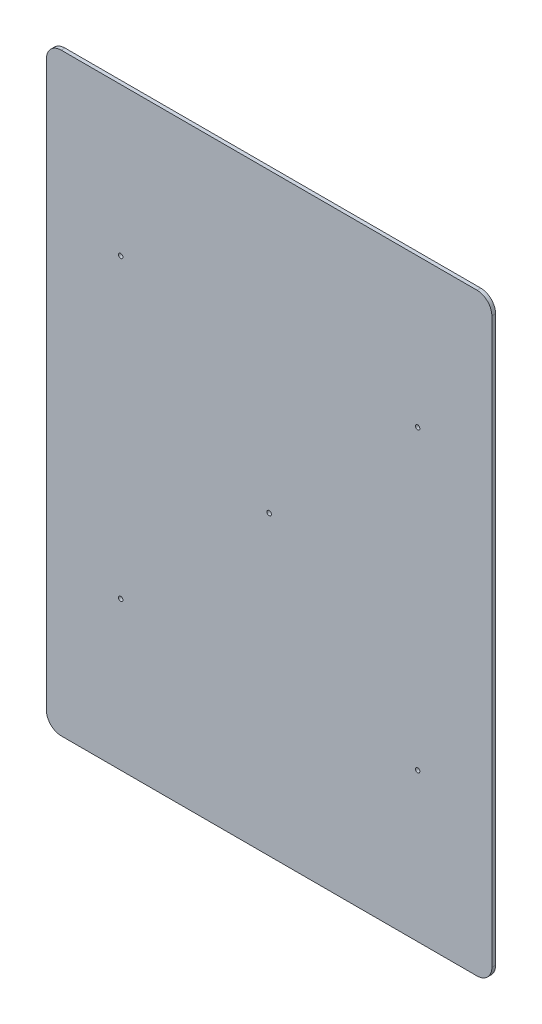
from build123d import *

# Parameters (mm, degrees)
ESQUISSE1_W             = 600
ESQUISSE1_H             = 800
BOSS_EXTRU_1_DEPTH      = 5
CONG_1_R                = 20
ESQUISSE2_R             = 3
ENL_V_MAT_EXTRU_1_DEPTH = 1001.012499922


with BuildPart() as part:
    # Esquisse1 → Boss.-Extru.1 (new body)
    with BuildSketch(Plane.XY):
        with Locations((-300, -400)):
            Rectangle(ESQUISSE1_W, ESQUISSE1_H)
    extrude(amount=BOSS_EXTRU_1_DEPTH)

    # Cong_1
    cong_1_edges = [part.edges().sort_by_distance(p)[0] for p in [
        (0, -800, 2.5),
        (-600, -800, 2.5),
        (-600, 0, 2.5),
        (0, 0, 2.5),
    ]]
    fillet(cong_1_edges, radius=CONG_1_R)

    # Esquisse2 → Enl_v. mat.-Extru.1 (cut, through all)
    with BuildSketch(Plane(origin=(0, 0, 0), x_dir=(-1, 0, 0), z_dir=(0, 0, -1))):
        with Locations((100, -600)):
            Circle(ESQUISSE2_R)
        with Locations((300, -400)):
            Circle(ESQUISSE2_R)
        with Locations((100, -200)):
            Circle(ESQUISSE2_R)
        with Locations((500, -200)):
            Circle(ESQUISSE2_R)
        with Locations((500, -600)):
            Circle(ESQUISSE2_R)
    extrude(amount=-ENL_V_MAT_EXTRU_1_DEPTH, mode=Mode.SUBTRACT)


solid = part.part
